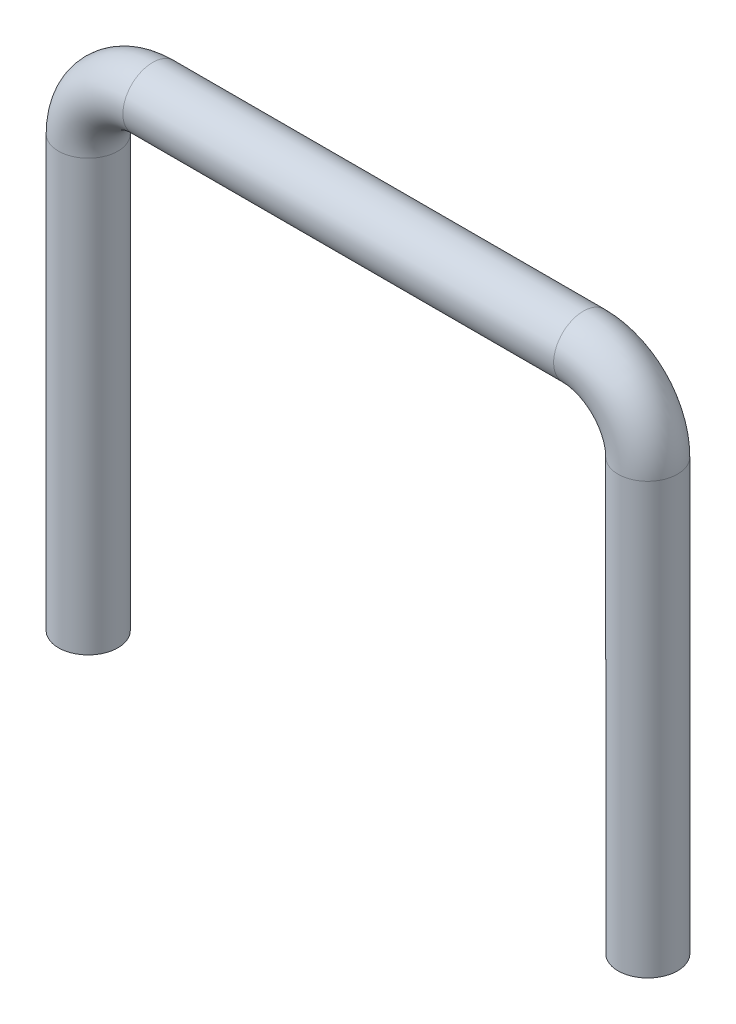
ISO-10303-21;
HEADER;
FILE_DESCRIPTION(('STEP AP214'),'2;1');
FILE_NAME('part.step','',(''),(''),'','','');
FILE_SCHEMA(('AUTOMOTIVE_DESIGN { 1 0 10303 214 1 1 1 1 }'));
ENDSEC;
DATA;
#1=APPLICATION_CONTEXT('core data for automotive mechanical design processes');
#2=APPLICATION_PROTOCOL_DEFINITION('international standard','automotive_design',2000,#1);
#3=PRODUCT_CONTEXT('',#1,'mechanical');
#4=PRODUCT('Part','Part','',(#3));
#5=PRODUCT_RELATED_PRODUCT_CATEGORY('part','',(#4));
#6=PRODUCT_DEFINITION_FORMATION('','',#4);
#7=PRODUCT_DEFINITION_CONTEXT('part definition',#1,'design');
#8=PRODUCT_DEFINITION('design','',#6,#7);
#9=PRODUCT_DEFINITION_SHAPE('','',#8);
#10=(LENGTH_UNIT() NAMED_UNIT(*) SI_UNIT(.MILLI.,.METRE.));
#11=(NAMED_UNIT(*) PLANE_ANGLE_UNIT() SI_UNIT($,.RADIAN.));
#12=(NAMED_UNIT(*) SI_UNIT($,.STERADIAN.) SOLID_ANGLE_UNIT());
#13=UNCERTAINTY_MEASURE_WITH_UNIT(LENGTH_MEASURE(1.E-05),#10,'distance_accuracy_value','');
#14=(GEOMETRIC_REPRESENTATION_CONTEXT(3) GLOBAL_UNCERTAINTY_ASSIGNED_CONTEXT((#13)) GLOBAL_UNIT_ASSIGNED_CONTEXT((#10,
#11,#12)) REPRESENTATION_CONTEXT('',''));
#15=CARTESIAN_POINT('',(0.,0.,0.));
#16=DIRECTION('',(0.,0.,1.));
#17=DIRECTION('',(1.,0.,0.));
#18=AXIS2_PLACEMENT_3D('',#15,#16,#17);
#19=CARTESIAN_POINT('',(564.550000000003,434.000000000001,0.));
#20=DIRECTION('',(0.,-1.00000000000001,0.));
#21=DIRECTION('',(1.,0.,0.));
#22=AXIS2_PLACEMENT_3D('',#19,#20,#21);
#23=CYLINDRICAL_SURFACE('',#22,30.);
#24=CARTESIAN_POINT('',(564.550000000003,434.000000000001,0.));
#25=DIRECTION('',(0.,-1.00000000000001,0.));
#26=DIRECTION('',(0.,0.,1.00000000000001));
#27=AXIS2_PLACEMENT_3D('',#24,#25,#26);
#28=CIRCLE('',#27,30.);
#29=CARTESIAN_POINT('',(594.55,434.000000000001,0.));
#30=VERTEX_POINT('',#29);
#31=EDGE_CURVE('E42',#30,#30,#28,.T.);
#32=ORIENTED_EDGE('',*,*,#31,.T.);
#33=EDGE_LOOP('',(#32));
#34=FACE_BOUND('',#33,.T.);
#35=CARTESIAN_POINT('',(564.55,2.77555756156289E-13,0.));
#36=DIRECTION('',(0.,-1.00000000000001,0.));
#37=DIRECTION('',(0.,0.,1.00000000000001));
#38=AXIS2_PLACEMENT_3D('',#35,#36,#37);
#39=CIRCLE('',#38,30.);
#40=CARTESIAN_POINT('',(564.55,2.77555756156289E-13,30.0000000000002));
#41=VERTEX_POINT('',#40);
#42=EDGE_CURVE('E10',#41,#41,#39,.T.);
#43=ORIENTED_EDGE('',*,*,#42,.F.);
#44=EDGE_LOOP('',(#43));
#45=FACE_BOUND('',#44,.T.);
#46=ADVANCED_FACE('F32',(#34,#45),#23,.T.);
#47=CARTESIAN_POINT('',(564.550000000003,434.000000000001,0.));
#48=DIRECTION('',(0.,-1.00000000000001,0.));
#49=DIRECTION('',(1.,0.,0.));
#50=AXIS2_PLACEMENT_3D('',#47,#48,#49);
#51=CYLINDRICAL_SURFACE('',#50,6.);
#52=CARTESIAN_POINT('',(564.550000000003,434.000000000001,0.));
#53=DIRECTION('',(0.,-1.00000000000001,0.));
#54=DIRECTION('',(0.,0.,1.00000000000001));
#55=AXIS2_PLACEMENT_3D('',#52,#53,#54);
#56=CIRCLE('',#55,6.);
#57=CARTESIAN_POINT('',(570.55,434.000000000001,0.));
#58=VERTEX_POINT('',#57);
#59=EDGE_CURVE('E46',#58,#58,#56,.T.);
#60=ORIENTED_EDGE('',*,*,#59,.F.);
#61=EDGE_LOOP('',(#60));
#62=FACE_BOUND('',#61,.T.);
#63=CARTESIAN_POINT('',(564.55,2.77555756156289E-13,0.));
#64=DIRECTION('',(0.,-1.00000000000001,0.));
#65=DIRECTION('',(0.,0.,1.00000000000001));
#66=AXIS2_PLACEMENT_3D('',#63,#64,#65);
#67=CIRCLE('',#66,6.);
#68=CARTESIAN_POINT('',(564.55,2.77555756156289E-13,6.00000000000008));
#69=VERTEX_POINT('',#68);
#70=EDGE_CURVE('E38',#69,#69,#67,.T.);
#71=ORIENTED_EDGE('',*,*,#70,.T.);
#72=EDGE_LOOP('',(#71));
#73=FACE_BOUND('',#72,.T.);
#74=ADVANCED_FACE('F96',(#62,#73),#51,.F.);
#75=CARTESIAN_POINT('',(499.55,434.000000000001,0.));
#76=DIRECTION('',(0.,0.,-1.00000000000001));
#77=DIRECTION('',(-1.,0.,0.));
#78=AXIS2_PLACEMENT_3D('',#75,#76,#77);
#79=TOROIDAL_SURFACE('',#78,64.9999999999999,30.);
#80=CARTESIAN_POINT('',(499.549999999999,499.,-1.2490009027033E-13));
#81=DIRECTION('',(1.,0.,0.));
#82=DIRECTION('',(0.,0.,1.00000000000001));
#83=AXIS2_PLACEMENT_3D('',#80,#81,#82);
#84=CIRCLE('',#83,30.);
#85=CARTESIAN_POINT('',(499.549999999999,529.000000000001,-2.01761684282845E-13));
#86=VERTEX_POINT('',#85);
#87=EDGE_CURVE('E51',#86,#86,#84,.T.);
#88=CARTESIAN_POINT('',(499.55,434.000000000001,0.));
#89=DIRECTION('',(0.,0.,-1.00000000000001));
#90=DIRECTION('',(-1.,0.,0.));
#91=AXIS2_PLACEMENT_3D('',#88,#89,#90);
#92=CIRCLE('',#91,94.9999999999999);
#93=EDGE_CURVE('',#86,#30,#92,.T.);
#94=ORIENTED_EDGE('',*,*,#87,.T.);
#95=ORIENTED_EDGE('',*,*,#31,.F.);
#96=ORIENTED_EDGE('',*,*,#93,.T.);
#97=ORIENTED_EDGE('',*,*,#93,.F.);
#98=EDGE_LOOP('',(#94,#96,#95,#97));
#99=FACE_BOUND('',#98,.T.);
#100=ADVANCED_FACE('F101',(#99),#79,.T.);
#101=CARTESIAN_POINT('',(499.55,434.000000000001,0.));
#102=DIRECTION('',(0.,0.,-1.00000000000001));
#103=DIRECTION('',(-1.,0.,0.));
#104=AXIS2_PLACEMENT_3D('',#101,#102,#103);
#105=TOROIDAL_SURFACE('',#104,64.9999999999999,6.);
#106=CARTESIAN_POINT('',(499.549999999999,499.,-1.2490009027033E-13));
#107=DIRECTION('',(1.,0.,0.));
#108=DIRECTION('',(0.,0.,1.00000000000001));
#109=AXIS2_PLACEMENT_3D('',#106,#107,#108);
#110=CIRCLE('',#109,6.);
#111=CARTESIAN_POINT('',(499.549999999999,505.000000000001,-1.40272409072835E-13));
#112=VERTEX_POINT('',#111);
#113=EDGE_CURVE('E54',#112,#112,#110,.T.);
#114=CARTESIAN_POINT('',(499.55,434.000000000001,0.));
#115=DIRECTION('',(0.,0.,-1.00000000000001));
#116=DIRECTION('',(-1.,0.,0.));
#117=AXIS2_PLACEMENT_3D('',#114,#115,#116);
#118=CIRCLE('',#117,71.);
#119=EDGE_CURVE('',#112,#58,#118,.T.);
#120=ORIENTED_EDGE('',*,*,#113,.F.);
#121=ORIENTED_EDGE('',*,*,#59,.T.);
#122=ORIENTED_EDGE('',*,*,#119,.T.);
#123=ORIENTED_EDGE('',*,*,#119,.F.);
#124=EDGE_LOOP('',(#120,#122,#121,#123));
#125=FACE_BOUND('',#124,.T.);
#126=ADVANCED_FACE('F107',(#125),#105,.F.);
#127=CARTESIAN_POINT('',(65.0000000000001,499.000000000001,-1.80411241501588E-13));
#128=DIRECTION('',(1.,0.,0.));
#129=DIRECTION('',(0.,0.,-1.00000000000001));
#130=AXIS2_PLACEMENT_3D('',#127,#128,#129);
#131=CYLINDRICAL_SURFACE('',#130,30.);
#132=CARTESIAN_POINT('',(65.0000000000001,499.000000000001,-1.80411241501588E-13));
#133=DIRECTION('',(1.,0.,0.));
#134=DIRECTION('',(0.,0.,1.00000000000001));
#135=AXIS2_PLACEMENT_3D('',#132,#133,#134);
#136=CIRCLE('',#135,30.);
#137=CARTESIAN_POINT('',(64.9999999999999,529.,-2.70083101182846E-13));
#138=VERTEX_POINT('',#137);
#139=EDGE_CURVE('E57',#138,#138,#136,.T.);
#140=ORIENTED_EDGE('',*,*,#139,.T.);
#141=EDGE_LOOP('',(#140));
#142=FACE_BOUND('',#141,.T.);
#143=ORIENTED_EDGE('',*,*,#87,.F.);
#144=EDGE_LOOP('',(#143));
#145=FACE_BOUND('',#144,.T.);
#146=ADVANCED_FACE('F113',(#142,#145),#131,.T.);
#147=CARTESIAN_POINT('',(65.0000000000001,499.000000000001,-1.80411241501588E-13));
#148=DIRECTION('',(1.,0.,0.));
#149=DIRECTION('',(0.,0.,-1.00000000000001));
#150=AXIS2_PLACEMENT_3D('',#147,#148,#149);
#151=CYLINDRICAL_SURFACE('',#150,6.);
#152=CARTESIAN_POINT('',(65.0000000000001,499.000000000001,-1.80411241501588E-13));
#153=DIRECTION('',(1.,0.,0.));
#154=DIRECTION('',(0.,0.,1.00000000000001));
#155=AXIS2_PLACEMENT_3D('',#152,#153,#154);
#156=CIRCLE('',#155,6.);
#157=CARTESIAN_POINT('',(65.,505.,-1.98345613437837E-13));
#158=VERTEX_POINT('',#157);
#159=EDGE_CURVE('E60',#158,#158,#156,.T.);
#160=ORIENTED_EDGE('',*,*,#159,.F.);
#161=EDGE_LOOP('',(#160));
#162=FACE_BOUND('',#161,.T.);
#163=ORIENTED_EDGE('',*,*,#113,.T.);
#164=EDGE_LOOP('',(#163));
#165=FACE_BOUND('',#164,.T.);
#166=ADVANCED_FACE('F119',(#162,#165),#151,.F.);
#167=CARTESIAN_POINT('',(65.0000000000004,434.,0.));
#168=DIRECTION('',(0.,0.,-1.00000000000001));
#169=DIRECTION('',(-1.,0.,0.));
#170=AXIS2_PLACEMENT_3D('',#167,#168,#169);
#171=TOROIDAL_SURFACE('',#170,65.,30.);
#172=CARTESIAN_POINT('',(3.33066907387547E-13,434.000000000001,0.));
#173=DIRECTION('',(0.,1.00000000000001,0.));
#174=DIRECTION('',(0.,0.,1.00000000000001));
#175=AXIS2_PLACEMENT_3D('',#172,#173,#174);
#176=CIRCLE('',#175,30.);
#177=CARTESIAN_POINT('',(-29.9999999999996,434.000000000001,0.));
#178=VERTEX_POINT('',#177);
#179=EDGE_CURVE('E63',#178,#178,#176,.T.);
#180=CARTESIAN_POINT('',(65.0000000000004,434.,0.));
#181=DIRECTION('',(0.,0.,-1.00000000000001));
#182=DIRECTION('',(-1.,0.,0.));
#183=AXIS2_PLACEMENT_3D('',#180,#181,#182);
#184=CIRCLE('',#183,95.);
#185=EDGE_CURVE('',#178,#138,#184,.T.);
#186=ORIENTED_EDGE('',*,*,#179,.T.);
#187=ORIENTED_EDGE('',*,*,#139,.F.);
#188=ORIENTED_EDGE('',*,*,#185,.T.);
#189=ORIENTED_EDGE('',*,*,#185,.F.);
#190=EDGE_LOOP('',(#186,#188,#187,#189));
#191=FACE_BOUND('',#190,.T.);
#192=ADVANCED_FACE('F123',(#191),#171,.T.);
#193=CARTESIAN_POINT('',(65.0000000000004,434.,0.));
#194=DIRECTION('',(0.,0.,-1.00000000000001));
#195=DIRECTION('',(-1.,0.,0.));
#196=AXIS2_PLACEMENT_3D('',#193,#194,#195);
#197=TOROIDAL_SURFACE('',#196,65.,6.);
#198=CARTESIAN_POINT('',(3.33066907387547E-13,434.000000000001,0.));
#199=DIRECTION('',(0.,1.00000000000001,0.));
#200=DIRECTION('',(0.,0.,1.00000000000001));
#201=AXIS2_PLACEMENT_3D('',#198,#199,#200);
#202=CIRCLE('',#201,6.);
#203=CARTESIAN_POINT('',(-5.99999999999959,434.000000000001,0.));
#204=VERTEX_POINT('',#203);
#205=EDGE_CURVE('E66',#204,#204,#202,.T.);
#206=CARTESIAN_POINT('',(65.0000000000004,434.,0.));
#207=DIRECTION('',(0.,0.,-1.00000000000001));
#208=DIRECTION('',(-1.,0.,0.));
#209=AXIS2_PLACEMENT_3D('',#206,#207,#208);
#210=CIRCLE('',#209,71.);
#211=EDGE_CURVE('',#204,#158,#210,.T.);
#212=ORIENTED_EDGE('',*,*,#205,.F.);
#213=ORIENTED_EDGE('',*,*,#159,.T.);
#214=ORIENTED_EDGE('',*,*,#211,.T.);
#215=ORIENTED_EDGE('',*,*,#211,.F.);
#216=EDGE_LOOP('',(#212,#214,#213,#215));
#217=FACE_BOUND('',#216,.T.);
#218=ADVANCED_FACE('F91',(#217),#197,.F.);
#219=CARTESIAN_POINT('',(3.33066907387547E-13,434.000000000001,0.));
#220=DIRECTION('',(0.,-1.00000000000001,0.));
#221=DIRECTION('',(1.,0.,0.));
#222=AXIS2_PLACEMENT_3D('',#219,#220,#221);
#223=CYLINDRICAL_SURFACE('',#222,30.);
#224=ORIENTED_EDGE('',*,*,#179,.F.);
#225=EDGE_LOOP('',(#224));
#226=FACE_BOUND('',#225,.T.);
#227=CARTESIAN_POINT('',(0.,0.,0.));
#228=DIRECTION('',(0.,1.00000000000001,0.));
#229=DIRECTION('',(0.,0.,1.00000000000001));
#230=AXIS2_PLACEMENT_3D('',#227,#228,#229);
#231=CIRCLE('',#230,30.);
#232=CARTESIAN_POINT('',(0.,0.,30.0000000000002));
#233=VERTEX_POINT('',#232);
#234=EDGE_CURVE('E69',#233,#233,#231,.T.);
#235=ORIENTED_EDGE('',*,*,#234,.T.);
#236=EDGE_LOOP('',(#235));
#237=FACE_BOUND('',#236,.T.);
#238=ADVANCED_FACE('F82',(#226,#237),#223,.T.);
#239=CARTESIAN_POINT('',(3.33066907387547E-13,434.000000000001,0.));
#240=DIRECTION('',(0.,-1.00000000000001,0.));
#241=DIRECTION('',(1.,0.,0.));
#242=AXIS2_PLACEMENT_3D('',#239,#240,#241);
#243=CYLINDRICAL_SURFACE('',#242,6.);
#244=ORIENTED_EDGE('',*,*,#205,.T.);
#245=EDGE_LOOP('',(#244));
#246=FACE_BOUND('',#245,.T.);
#247=CARTESIAN_POINT('',(0.,0.,0.));
#248=DIRECTION('',(0.,1.00000000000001,0.));
#249=DIRECTION('',(0.,0.,1.00000000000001));
#250=AXIS2_PLACEMENT_3D('',#247,#248,#249);
#251=CIRCLE('',#250,6.);
#252=CARTESIAN_POINT('',(0.,0.,6.00000000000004));
#253=VERTEX_POINT('',#252);
#254=EDGE_CURVE('E72',#253,#253,#251,.T.);
#255=ORIENTED_EDGE('',*,*,#254,.F.);
#256=EDGE_LOOP('',(#255));
#257=FACE_BOUND('',#256,.T.);
#258=ADVANCED_FACE('F79',(#246,#257),#243,.F.);
#259=CARTESIAN_POINT('',(564.55,2.77555756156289E-13,0.));
#260=DIRECTION('',(0.,-1.00000000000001,0.));
#261=DIRECTION('',(0.,0.,1.00000000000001));
#262=AXIS2_PLACEMENT_3D('',#259,#260,#261);
#263=PLANE('',#262);
#264=ORIENTED_EDGE('',*,*,#70,.F.);
#265=EDGE_LOOP('',(#264));
#266=FACE_BOUND('',#265,.T.);
#267=ORIENTED_EDGE('',*,*,#42,.T.);
#268=EDGE_LOOP('',(#267));
#269=FACE_BOUND('',#268,.T.);
#270=ADVANCED_FACE('F81',(#266,#269),#263,.T.);
#271=CARTESIAN_POINT('',(0.,0.,0.));
#272=DIRECTION('',(0.,1.00000000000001,0.));
#273=DIRECTION('',(0.,0.,1.00000000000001));
#274=AXIS2_PLACEMENT_3D('',#271,#272,#273);
#275=PLANE('',#274);
#276=ORIENTED_EDGE('',*,*,#254,.T.);
#277=EDGE_LOOP('',(#276));
#278=FACE_BOUND('',#277,.T.);
#279=ORIENTED_EDGE('',*,*,#234,.F.);
#280=EDGE_LOOP('',(#279));
#281=FACE_BOUND('',#280,.T.);
#282=ADVANCED_FACE('F76',(#278,#281),#275,.F.);
#283=CLOSED_SHELL('',(#46,#74,#100,#126,#146,#166,#192,#218,#238,#258,#270,#282));
#284=MANIFOLD_SOLID_BREP('B2',#283);
#285=ADVANCED_BREP_SHAPE_REPRESENTATION('',(#18,#284),#14);
#286=SHAPE_DEFINITION_REPRESENTATION(#9,#285);
ENDSEC;
END-ISO-10303-21;
